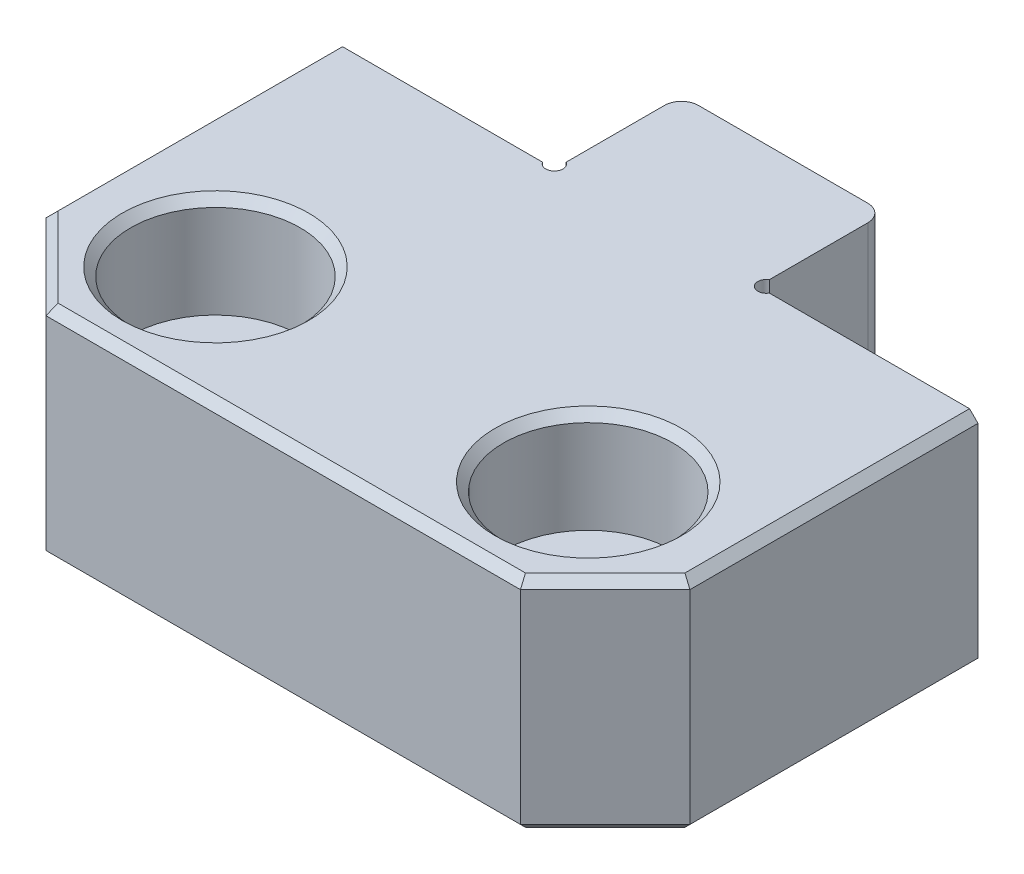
from build123d import *

# Parameters (mm, degrees)
SKETCH2_R          = 2.9
EXTRUDE1_DEPTH     = 13
FILLET1_R          = 1
CHAMFER1_SIZE      = 5
SKETCH3_R          = 5
CUT_EXTRUDE1_DEPTH = 6
CHAMFER2_SIZE      = 0.5
CHAMFER3_SIZE      = 0.5
SKETCH4_W          = 29.689544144
SKETCH4_H          = 18.924566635
CUT_EXTRUDE2_DEPTH = 0.5


with BuildPart() as part:
    # Sketch2 → Extrude1 (new body)
    with BuildSketch(Plane(origin=(0, 0, 0), x_dir=(1, 0, 0), z_dir=(0, 1, 0))):
        with BuildLine():
            Line((-6, 0.693940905), (-6, 7.5))
            Line((-6, 7.5), (6, 7.5))
            Line((6, 7.5), (6, 0.684678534))
            ThreePointArc((6, 0.684678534), (5.900446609, -0.099553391), (6.684678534, 0))
            Line((6.684678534, 0), (19, 0))
            Line((19, 0), (19, -22))
            Line((19, -22), (-19, -22))
            Line((-19, -22), (-19, 0))
            Line((-19, 0), (-6.693940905, 0))
            ThreePointArc((-6.693940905, 0), (-5.894789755, -0.105210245), (-6, 0.693940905))
        make_face()
        with Locations(Location((-11, -15, 0), (0, 0, 270))):
            Circle(SKETCH2_R, mode=Mode.SUBTRACT)
        with Locations(Location((11, -15, 0), (0, 0, 270))):
            Circle(SKETCH2_R, mode=Mode.SUBTRACT)
    extrude(amount=-EXTRUDE1_DEPTH)

    # Fillet1
    fillet1_edges = [part.edges().sort_by_distance(p)[0] for p in [
        (-6, -6.5, -7.5),
        (6, -6.5, -7.5),
    ]]
    fillet(fillet1_edges, radius=FILLET1_R)

    # Chamfer1
    chamfer1_edges = [part.edges().sort_by_distance(p)[0] for p in [
        (19, -6.5, 22),
        (-19, -6.5, 22),
    ]]
    chamfer(chamfer1_edges, length=CHAMFER1_SIZE)

    # Sketch3 → Cut-Extrude1 (cut)
    with BuildSketch(Plane(origin=(0, 0, 0), x_dir=(1, 0, 0), z_dir=(0, 1, 0))):
        with Locations(Location((-11, -15, 0), (0, 0, 270))):
            Circle(SKETCH3_R)
    cut_extrude1 = extrude(amount=-CUT_EXTRUDE1_DEPTH, mode=Mode.SUBTRACT)

    # Mirror1: Cut-Extrude1 across plane
    add(cut_extrude1.mirror(Plane(origin=(0, 0, 0), x_dir=(0, 0, 1), z_dir=(1, 0, 0))), mode=Mode.SUBTRACT)

    # Chamfer2
    chamfer2_edges = [part.edges().sort_by_distance(p)[0] for p in [
        (-19, 0, 8.5),
        (-19, -13, 8.5),
        (0, 0, 22),
        (0, -13, 22),
        (19, 0, 8.5),
        (-16.5, 0, 19.5),
        (16.5, 0, 19.5),
        (19, -13, 8.5),
        (-16.5, -13, 19.5),
        (16.5, -13, 19.5),
    ]]
    chamfer(chamfer2_edges, length=CHAMFER2_SIZE)

    # Chamfer3
    chamfer3_edges = [part.edges().sort_by_distance(p)[0] for p in [
        (-11, 0, 10),
        (11, 0, 10),
    ]]
    chamfer(chamfer3_edges, length=CHAMFER3_SIZE)

    # Sketch4 → Cut-Extrude2 (cut)
    with BuildSketch(Plane.XZ.offset(13)):
        with Locations((-1.389292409, -9.462283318)):
            Rectangle(SKETCH4_W, SKETCH4_H)
    extrude(amount=-CUT_EXTRUDE2_DEPTH, mode=Mode.SUBTRACT)


solid = part.part
